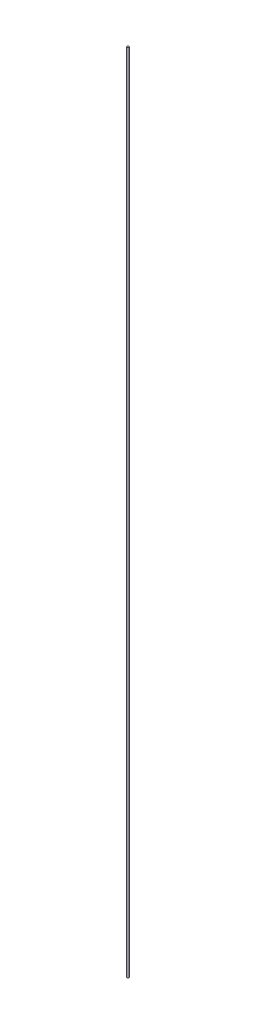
from build123d import *

# Parameters (mm, degrees)
ESQUISSE2_R = 2.5


with BuildPart() as part:
    # Balayage1: sweep along a path in Esquisse1
    with BuildLine(Plane.XY) as balayage1_path:
        Line((0, 0), (0, 2000))
    # Esquisse2 → Balayage1 (sweep)
    with BuildSketch(Plane(origin=(0, 0, 0), x_dir=(1, 0, 0), z_dir=(0, 1, 0))):
        Circle(ESQUISSE2_R)
    sweep(path=balayage1_path.line)


solid = part.part
